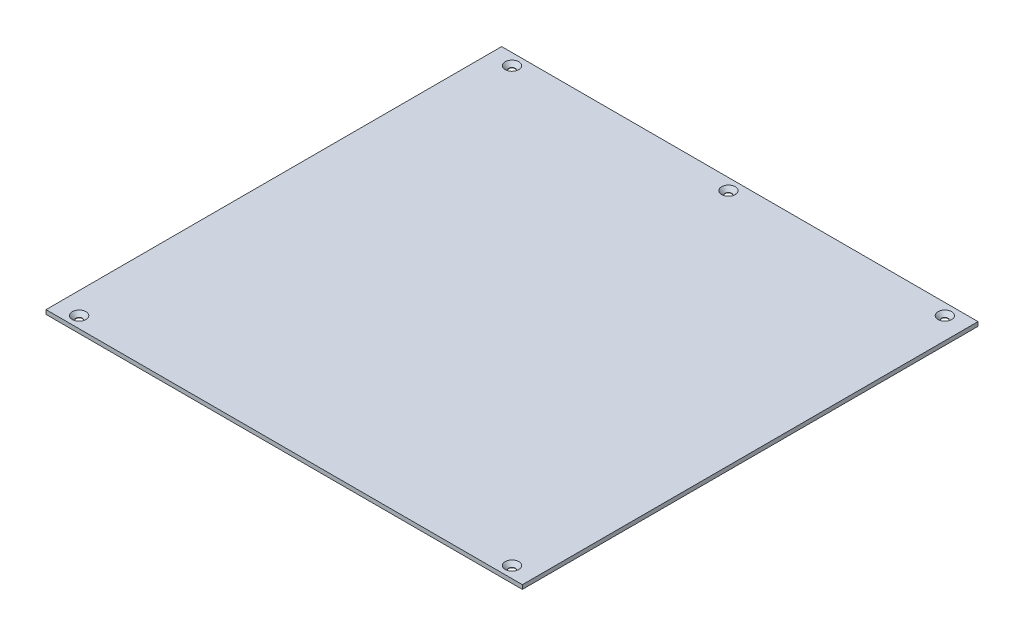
from build123d import *

# Parameters (mm, degrees)
CROQUIS1_W              = 230
CROQUIS1_H              = 220
CROQUIS1_R              = 1.5
SALIENTE_EXTRUIR2_DEPTH = 2
CHAMFER_1_SIZE          = 1.8


with BuildPart() as part:
    # Croquis1 → Saliente-Extruir2 (new body)
    with BuildSketch(Plane(origin=(0, 0, 0), x_dir=(1, 0, 0), z_dir=(0, 1, 0))):
        Rectangle(CROQUIS1_W, CROQUIS1_H)
        with Locations(Location((104.5, 104.5, 0), (0, 0, 270))):
            Circle(CROQUIS1_R, mode=Mode.SUBTRACT)
        with Locations(Location((-104.5, 104.5, 0), (0, 0, 90))):
            Circle(CROQUIS1_R, mode=Mode.SUBTRACT)
        with Locations(Location((104.5, -104.5, 0), (0, 0, 90))):
            Circle(CROQUIS1_R, mode=Mode.SUBTRACT)
        with Locations(Location((-104.5, -104.5, 0), (0, 0, 270))):
            Circle(CROQUIS1_R, mode=Mode.SUBTRACT)
        with Locations(Location((0, 104.5, 0), (0, 0, 270))):
            Circle(CROQUIS1_R, mode=Mode.SUBTRACT)
    extrude(amount=SALIENTE_EXTRUIR2_DEPTH)

    # Chamfer 1
    chamfer_1_edges = [part.edges().sort_by_distance(p)[0] for p in [
        (104.5, 2, -106),
        (-104.5, 2, -103),
        (104.5, 2, 106),
        (-104.5, 2, 103),
        (0, 2, -106),
    ]]
    chamfer(chamfer_1_edges, length=CHAMFER_1_SIZE)


solid = part.part
